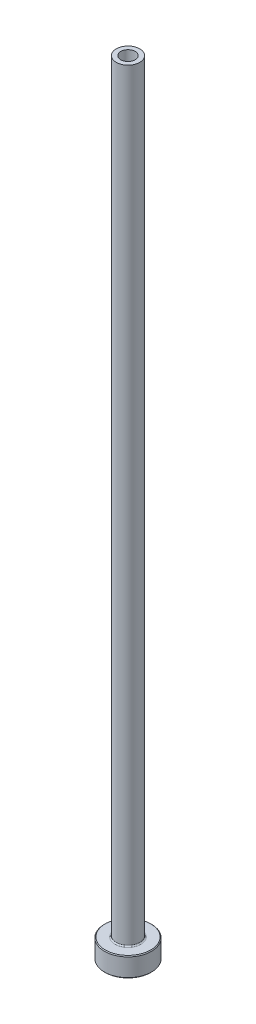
ISO-10303-21;
HEADER;
FILE_DESCRIPTION(('STEP AP214'),'2;1');
FILE_NAME('part.step','',(''),(''),'','','');
FILE_SCHEMA(('AUTOMOTIVE_DESIGN { 1 0 10303 214 1 1 1 1 }'));
ENDSEC;
DATA;
#1=APPLICATION_CONTEXT('core data for automotive mechanical design processes');
#2=APPLICATION_PROTOCOL_DEFINITION('international standard','automotive_design',2000,#1);
#3=PRODUCT_CONTEXT('',#1,'mechanical');
#4=PRODUCT('Part','Part','',(#3));
#5=PRODUCT_RELATED_PRODUCT_CATEGORY('part','',(#4));
#6=PRODUCT_DEFINITION_FORMATION('','',#4);
#7=PRODUCT_DEFINITION_CONTEXT('part definition',#1,'design');
#8=PRODUCT_DEFINITION('design','',#6,#7);
#9=PRODUCT_DEFINITION_SHAPE('','',#8);
#10=(LENGTH_UNIT() NAMED_UNIT(*) SI_UNIT(.MILLI.,.METRE.));
#11=(NAMED_UNIT(*) PLANE_ANGLE_UNIT() SI_UNIT($,.RADIAN.));
#12=(NAMED_UNIT(*) SI_UNIT($,.STERADIAN.) SOLID_ANGLE_UNIT());
#13=UNCERTAINTY_MEASURE_WITH_UNIT(LENGTH_MEASURE(1.E-05),#10,'distance_accuracy_value','');
#14=(GEOMETRIC_REPRESENTATION_CONTEXT(3) GLOBAL_UNCERTAINTY_ASSIGNED_CONTEXT((#13)) GLOBAL_UNIT_ASSIGNED_CONTEXT((#10,
#11,#12)) REPRESENTATION_CONTEXT('',''));
#15=CARTESIAN_POINT('',(0.,0.,0.));
#16=DIRECTION('',(0.,0.,1.));
#17=DIRECTION('',(1.,0.,0.));
#18=AXIS2_PLACEMENT_3D('',#15,#16,#17);
#19=CARTESIAN_POINT('',(0.,92.1876809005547,0.));
#20=DIRECTION('',(0.,1.,0.));
#21=DIRECTION('',(0.,0.,1.));
#22=AXIS2_PLACEMENT_3D('',#19,#20,#21);
#23=CYLINDRICAL_SURFACE('',#22,1.85);
#24=CARTESIAN_POINT('',(0.,200.,0.));
#25=DIRECTION('',(0.,1.,0.));
#26=DIRECTION('',(0.,0.,1.));
#27=AXIS2_PLACEMENT_3D('',#24,#25,#26);
#28=CIRCLE('',#27,1.85);
#29=CARTESIAN_POINT('',(0.,200.,1.85));
#30=VERTEX_POINT('',#29);
#31=EDGE_CURVE('E62',#30,#30,#28,.T.);
#32=ORIENTED_EDGE('',*,*,#31,.T.);
#33=EDGE_LOOP('',(#32));
#34=FACE_BOUND('',#33,.T.);
#35=CARTESIAN_POINT('',(0.,155.,0.));
#36=DIRECTION('',(0.,1.,0.));
#37=DIRECTION('',(0.,0.,1.));
#38=AXIS2_PLACEMENT_3D('',#35,#36,#37);
#39=CIRCLE('',#38,1.85);
#40=CARTESIAN_POINT('',(0.,155.,1.85));
#41=VERTEX_POINT('',#40);
#42=EDGE_CURVE('E71',#41,#41,#39,.T.);
#43=ORIENTED_EDGE('',*,*,#42,.F.);
#44=EDGE_LOOP('',(#43));
#45=FACE_BOUND('',#44,.T.);
#46=ADVANCED_FACE('F30',(#34,#45),#23,.F.);
#47=CARTESIAN_POINT('',(-1.85,200.,0.));
#48=DIRECTION('',(0.,1.,0.));
#49=DIRECTION('',(0.,0.,1.));
#50=AXIS2_PLACEMENT_3D('',#47,#48,#49);
#51=PLANE('',#50);
#52=CARTESIAN_POINT('',(0.,200.,0.));
#53=DIRECTION('',(0.,1.,0.));
#54=DIRECTION('',(0.,0.,1.));
#55=AXIS2_PLACEMENT_3D('',#52,#53,#54);
#56=CIRCLE('',#55,3.00000000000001);
#57=CARTESIAN_POINT('',(0.,200.,3.00000000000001));
#58=VERTEX_POINT('',#57);
#59=EDGE_CURVE('E65',#58,#58,#56,.T.);
#60=ORIENTED_EDGE('',*,*,#59,.T.);
#61=EDGE_LOOP('',(#60));
#62=FACE_BOUND('',#61,.T.);
#63=ORIENTED_EDGE('',*,*,#31,.F.);
#64=EDGE_LOOP('',(#63));
#65=FACE_BOUND('',#64,.T.);
#66=ADVANCED_FACE('F79',(#62,#65),#51,.T.);
#67=CARTESIAN_POINT('',(0.,92.1876809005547,0.));
#68=DIRECTION('',(0.,1.,0.));
#69=DIRECTION('',(0.,0.,1.));
#70=AXIS2_PLACEMENT_3D('',#67,#68,#69);
#71=CYLINDRICAL_SURFACE('',#70,3.);
#72=CARTESIAN_POINT('',(0.,5.3,0.));
#73=DIRECTION('',(0.,1.,0.));
#74=DIRECTION('',(0.,0.,1.));
#75=AXIS2_PLACEMENT_3D('',#72,#73,#74);
#76=CIRCLE('',#75,3.);
#77=CARTESIAN_POINT('',(0.,5.3,3.));
#78=VERTEX_POINT('',#77);
#79=EDGE_CURVE('E59',#78,#78,#76,.T.);
#80=ORIENTED_EDGE('',*,*,#79,.T.);
#81=EDGE_LOOP('',(#80));
#82=FACE_BOUND('',#81,.T.);
#83=ORIENTED_EDGE('',*,*,#59,.F.);
#84=EDGE_LOOP('',(#83));
#85=FACE_BOUND('',#84,.T.);
#86=ADVANCED_FACE('F85',(#82,#85),#71,.T.);
#87=CARTESIAN_POINT('',(-2.99999999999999,5.,0.));
#88=DIRECTION('',(0.,1.,0.));
#89=DIRECTION('',(0.,0.,1.));
#90=AXIS2_PLACEMENT_3D('',#87,#88,#89);
#91=PLANE('',#90);
#92=CARTESIAN_POINT('',(0.,5.,0.));
#93=DIRECTION('',(0.,1.,0.));
#94=DIRECTION('',(0.,0.,1.));
#95=AXIS2_PLACEMENT_3D('',#92,#93,#94);
#96=CIRCLE('',#95,5.79999999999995);
#97=CARTESIAN_POINT('',(0.,5.,5.79999999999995));
#98=VERTEX_POINT('',#97);
#99=EDGE_CURVE('E53',#98,#98,#96,.T.);
#100=ORIENTED_EDGE('',*,*,#99,.T.);
#101=EDGE_LOOP('',(#100));
#102=FACE_BOUND('',#101,.T.);
#103=CARTESIAN_POINT('',(0.,5.,0.));
#104=DIRECTION('',(0.,1.,0.));
#105=DIRECTION('',(0.,0.,1.));
#106=AXIS2_PLACEMENT_3D('',#103,#104,#105);
#107=CIRCLE('',#106,3.3);
#108=CARTESIAN_POINT('',(0.,5.,3.3));
#109=VERTEX_POINT('',#108);
#110=EDGE_CURVE('E56',#109,#109,#107,.F.);
#111=ORIENTED_EDGE('',*,*,#110,.T.);
#112=EDGE_LOOP('',(#111));
#113=FACE_BOUND('',#112,.T.);
#114=ADVANCED_FACE('F111',(#102,#113),#91,.T.);
#115=CARTESIAN_POINT('',(0.,92.1876809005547,0.));
#116=DIRECTION('',(0.,1.,0.));
#117=DIRECTION('',(0.,0.,1.));
#118=AXIS2_PLACEMENT_3D('',#115,#116,#117);
#119=CYLINDRICAL_SURFACE('',#118,5.99999999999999);
#120=CARTESIAN_POINT('',(0.,4.79999999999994,0.));
#121=DIRECTION('',(0.,1.,0.));
#122=DIRECTION('',(0.,0.,1.));
#123=AXIS2_PLACEMENT_3D('',#120,#121,#122);
#124=CIRCLE('',#123,5.99999999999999);
#125=CARTESIAN_POINT('',(0.,4.79999999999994,5.99999999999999));
#126=VERTEX_POINT('',#125);
#127=EDGE_CURVE('E45',#126,#126,#124,.F.);
#128=ORIENTED_EDGE('',*,*,#127,.T.);
#129=EDGE_LOOP('',(#128));
#130=FACE_BOUND('',#129,.T.);
#131=CARTESIAN_POINT('',(0.,0.20000000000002,0.));
#132=DIRECTION('',(0.,-1.,0.));
#133=DIRECTION('',(0.,0.,-1.));
#134=AXIS2_PLACEMENT_3D('',#131,#132,#133);
#135=CIRCLE('',#134,5.99999999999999);
#136=CARTESIAN_POINT('',(0.,0.20000000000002,-5.99999999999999));
#137=VERTEX_POINT('',#136);
#138=EDGE_CURVE('E50',#137,#137,#135,.F.);
#139=ORIENTED_EDGE('',*,*,#138,.T.);
#140=EDGE_LOOP('',(#139));
#141=FACE_BOUND('',#140,.T.);
#142=ADVANCED_FACE('F108',(#130,#141),#119,.T.);
#143=CARTESIAN_POINT('',(-5.99999999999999,0.,0.));
#144=DIRECTION('',(0.,-1.,0.));
#145=DIRECTION('',(0.,0.,-1.));
#146=AXIS2_PLACEMENT_3D('',#143,#144,#145);
#147=PLANE('',#146);
#148=CARTESIAN_POINT('',(0.,0.,0.));
#149=DIRECTION('',(0.,-1.,0.));
#150=DIRECTION('',(0.,0.,-1.));
#151=AXIS2_PLACEMENT_3D('',#148,#149,#150);
#152=CIRCLE('',#151,2.59999999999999);
#153=CARTESIAN_POINT('',(0.,0.,-2.59999999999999));
#154=VERTEX_POINT('',#153);
#155=EDGE_CURVE('E37',#154,#154,#152,.F.);
#156=ORIENTED_EDGE('',*,*,#155,.T.);
#157=EDGE_LOOP('',(#156));
#158=FACE_BOUND('',#157,.T.);
#159=CARTESIAN_POINT('',(0.,0.,0.));
#160=DIRECTION('',(0.,-1.,0.));
#161=DIRECTION('',(0.,0.,-1.));
#162=AXIS2_PLACEMENT_3D('',#159,#160,#161);
#163=CIRCLE('',#162,5.8);
#164=CARTESIAN_POINT('',(0.,0.,-5.8));
#165=VERTEX_POINT('',#164);
#166=EDGE_CURVE('E41',#165,#165,#163,.T.);
#167=ORIENTED_EDGE('',*,*,#166,.T.);
#168=EDGE_LOOP('',(#167));
#169=FACE_BOUND('',#168,.T.);
#170=ADVANCED_FACE('F110',(#158,#169),#147,.T.);
#171=CARTESIAN_POINT('',(0.,92.1876809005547,0.));
#172=DIRECTION('',(0.,1.,0.));
#173=DIRECTION('',(0.,0.,1.));
#174=AXIS2_PLACEMENT_3D('',#171,#172,#173);
#175=CYLINDRICAL_SURFACE('',#174,2.1);
#176=CARTESIAN_POINT('',(0.,0.500000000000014,0.));
#177=DIRECTION('',(0.,-1.,0.));
#178=DIRECTION('',(0.,0.,-1.));
#179=AXIS2_PLACEMENT_3D('',#176,#177,#178);
#180=CIRCLE('',#179,2.1);
#181=CARTESIAN_POINT('',(0.,0.500000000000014,-2.1));
#182=VERTEX_POINT('',#181);
#183=EDGE_CURVE('E10',#182,#182,#180,.T.);
#184=ORIENTED_EDGE('',*,*,#183,.T.);
#185=EDGE_LOOP('',(#184));
#186=FACE_BOUND('',#185,.T.);
#187=CARTESIAN_POINT('',(0.,143.,0.));
#188=DIRECTION('',(0.,1.,0.));
#189=DIRECTION('',(0.,0.,1.));
#190=AXIS2_PLACEMENT_3D('',#187,#188,#189);
#191=CIRCLE('',#190,2.10000000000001);
#192=CARTESIAN_POINT('',(0.,143.,2.10000000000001));
#193=VERTEX_POINT('',#192);
#194=EDGE_CURVE('E68',#193,#193,#191,.T.);
#195=ORIENTED_EDGE('',*,*,#194,.T.);
#196=EDGE_LOOP('',(#195));
#197=FACE_BOUND('',#196,.T.);
#198=ADVANCED_FACE('F118',(#186,#197),#175,.F.);
#199=CARTESIAN_POINT('',(0.,143.,0.));
#200=DIRECTION('',(0.,-1.,0.));
#201=DIRECTION('',(0.,0.,-1.));
#202=AXIS2_PLACEMENT_3D('',#199,#200,#201);
#203=CONICAL_SURFACE('',#202,2.10000000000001,0.0208303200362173);
#204=ORIENTED_EDGE('',*,*,#42,.T.);
#205=EDGE_LOOP('',(#204));
#206=FACE_BOUND('',#205,.T.);
#207=ORIENTED_EDGE('',*,*,#194,.F.);
#208=EDGE_LOOP('',(#207));
#209=FACE_BOUND('',#208,.T.);
#210=ADVANCED_FACE('F75',(#206,#209),#203,.F.);
#211=CARTESIAN_POINT('',(0.,5.3,0.));
#212=DIRECTION('',(0.,1.,0.));
#213=DIRECTION('',(0.,0.,1.));
#214=AXIS2_PLACEMENT_3D('',#211,#212,#213);
#215=TOROIDAL_SURFACE('',#214,3.3,0.3);
#216=ORIENTED_EDGE('',*,*,#110,.F.);
#217=EDGE_LOOP('',(#216));
#218=FACE_BOUND('',#217,.T.);
#219=ORIENTED_EDGE('',*,*,#79,.F.);
#220=EDGE_LOOP('',(#219));
#221=FACE_BOUND('',#220,.T.);
#222=ADVANCED_FACE('F90',(#218,#221),#215,.F.);
#223=CARTESIAN_POINT('',(0.,5.,0.));
#224=DIRECTION('',(0.,-1.,0.));
#225=DIRECTION('',(0.,0.,-1.));
#226=AXIS2_PLACEMENT_3D('',#223,#224,#225);
#227=CONICAL_SURFACE('',#226,5.79999999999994,0.785398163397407);
#228=ORIENTED_EDGE('',*,*,#127,.F.);
#229=EDGE_LOOP('',(#228));
#230=FACE_BOUND('',#229,.T.);
#231=ORIENTED_EDGE('',*,*,#99,.F.);
#232=EDGE_LOOP('',(#231));
#233=FACE_BOUND('',#232,.T.);
#234=ADVANCED_FACE('F93',(#230,#233),#227,.T.);
#235=CARTESIAN_POINT('',(0.,0.20000000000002,0.));
#236=DIRECTION('',(0.,1.,0.));
#237=DIRECTION('',(0.,0.,1.));
#238=AXIS2_PLACEMENT_3D('',#235,#236,#237);
#239=CONICAL_SURFACE('',#238,5.99999999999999,0.78539816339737);
#240=ORIENTED_EDGE('',*,*,#166,.F.);
#241=EDGE_LOOP('',(#240));
#242=FACE_BOUND('',#241,.T.);
#243=ORIENTED_EDGE('',*,*,#138,.F.);
#244=EDGE_LOOP('',(#243));
#245=FACE_BOUND('',#244,.T.);
#246=ADVANCED_FACE('F96',(#242,#245),#239,.T.);
#247=CARTESIAN_POINT('',(0.,0.,0.));
#248=DIRECTION('',(0.,-1.,0.));
#249=DIRECTION('',(0.,0.,-1.));
#250=AXIS2_PLACEMENT_3D('',#247,#248,#249);
#251=CONICAL_SURFACE('',#250,2.59999999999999,0.785398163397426);
#252=ORIENTED_EDGE('',*,*,#183,.F.);
#253=EDGE_LOOP('',(#252));
#254=FACE_BOUND('',#253,.T.);
#255=ORIENTED_EDGE('',*,*,#155,.F.);
#256=EDGE_LOOP('',(#255));
#257=FACE_BOUND('',#256,.T.);
#258=ADVANCED_FACE('F32',(#254,#257),#251,.F.);
#259=CLOSED_SHELL('',(#46,#66,#86,#114,#142,#170,#198,#210,#222,#234,#246,#258));
#260=MANIFOLD_SOLID_BREP('B2',#259);
#261=ADVANCED_BREP_SHAPE_REPRESENTATION('',(#18,#260),#14);
#262=SHAPE_DEFINITION_REPRESENTATION(#9,#261);
ENDSEC;
END-ISO-10303-21;
